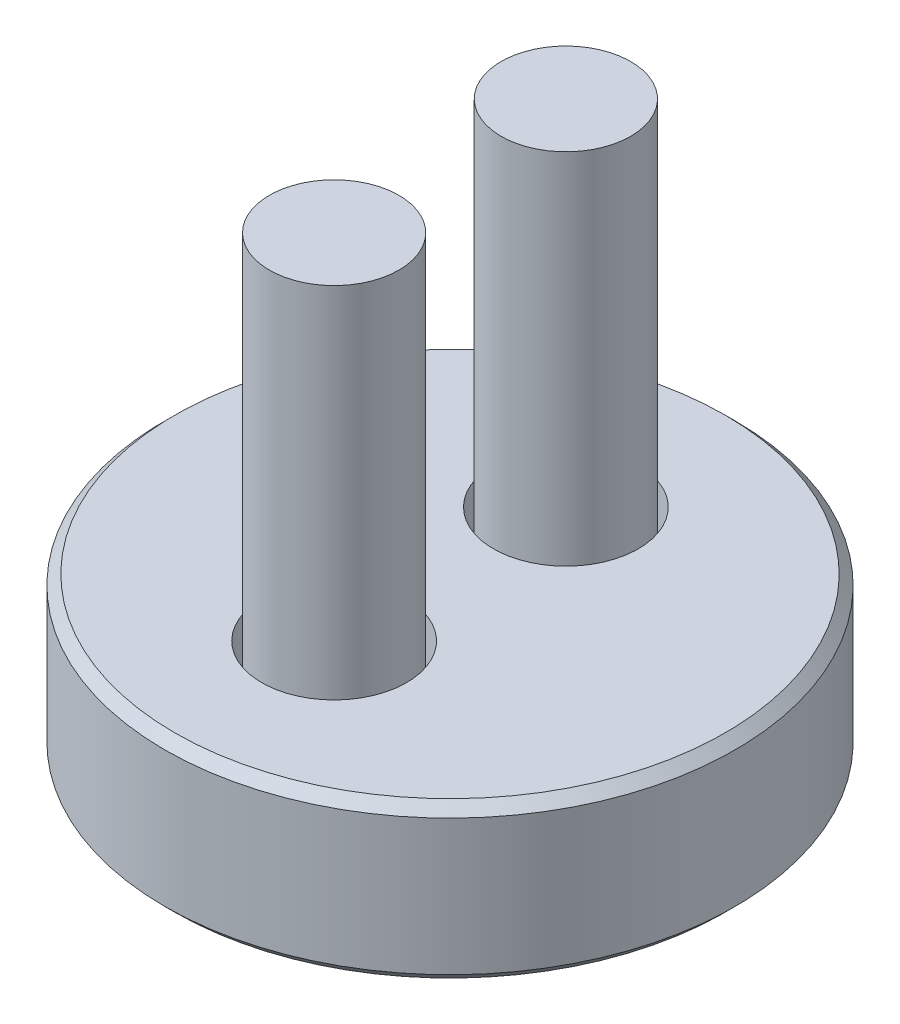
ISO-10303-21;
HEADER;
FILE_DESCRIPTION(('STEP AP214'),'2;1');
FILE_NAME('part.step','',(''),(''),'','','');
FILE_SCHEMA(('AUTOMOTIVE_DESIGN { 1 0 10303 214 1 1 1 1 }'));
ENDSEC;
DATA;
#1=APPLICATION_CONTEXT('core data for automotive mechanical design processes');
#2=APPLICATION_PROTOCOL_DEFINITION('international standard','automotive_design',2000,#1);
#3=PRODUCT_CONTEXT('',#1,'mechanical');
#4=PRODUCT('Part','Part','',(#3));
#5=PRODUCT_RELATED_PRODUCT_CATEGORY('part','',(#4));
#6=PRODUCT_DEFINITION_FORMATION('','',#4);
#7=PRODUCT_DEFINITION_CONTEXT('part definition',#1,'design');
#8=PRODUCT_DEFINITION('design','',#6,#7);
#9=PRODUCT_DEFINITION_SHAPE('','',#8);
#10=(LENGTH_UNIT() NAMED_UNIT(*) SI_UNIT(.MILLI.,.METRE.));
#11=(NAMED_UNIT(*) PLANE_ANGLE_UNIT() SI_UNIT($,.RADIAN.));
#12=(NAMED_UNIT(*) SI_UNIT($,.STERADIAN.) SOLID_ANGLE_UNIT());
#13=UNCERTAINTY_MEASURE_WITH_UNIT(LENGTH_MEASURE(1.E-05),#10,'distance_accuracy_value','');
#14=(GEOMETRIC_REPRESENTATION_CONTEXT(3) GLOBAL_UNCERTAINTY_ASSIGNED_CONTEXT((#13)) GLOBAL_UNIT_ASSIGNED_CONTEXT((#10,
#11,#12)) REPRESENTATION_CONTEXT('',''));
#15=CARTESIAN_POINT('',(0.,0.,0.));
#16=DIRECTION('',(0.,0.,1.));
#17=DIRECTION('',(1.,0.,0.));
#18=AXIS2_PLACEMENT_3D('',#15,#16,#17);
#19=CARTESIAN_POINT('',(0.,19.6322,4.4704));
#20=DIRECTION('',(0.,1.,0.));
#21=DIRECTION('',(1.,0.,0.));
#22=AXIS2_PLACEMENT_3D('',#19,#20,#21);
#23=PLANE('',#22);
#24=CARTESIAN_POINT('',(0.,19.6322,4.4704));
#25=DIRECTION('',(0.,-1.,0.));
#26=DIRECTION('',(1.,0.,0.));
#27=AXIS2_PLACEMENT_3D('',#24,#25,#26);
#28=CIRCLE('',#27,2.5);
#29=CARTESIAN_POINT('',(2.5,19.6322,4.4704));
#30=VERTEX_POINT('',#29);
#31=EDGE_CURVE('E12',#30,#30,#28,.T.);
#32=ORIENTED_EDGE('',*,*,#31,.F.);
#33=EDGE_LOOP('',(#32));
#34=FACE_BOUND('',#33,.T.);
#35=ADVANCED_FACE('F47',(#34),#23,.T.);
#36=CARTESIAN_POINT('',(0.,19.6322,4.4704));
#37=DIRECTION('',(0.,1.,0.));
#38=DIRECTION('',(1.,0.,0.));
#39=AXIS2_PLACEMENT_3D('',#36,#37,#38);
#40=CYLINDRICAL_SURFACE('',#39,2.5);
#41=CARTESIAN_POINT('',(0.,3.6322,4.4704));
#42=DIRECTION('',(0.,-1.,0.));
#43=DIRECTION('',(1.,0.,0.));
#44=AXIS2_PLACEMENT_3D('',#41,#42,#43);
#45=CIRCLE('',#44,2.5);
#46=CARTESIAN_POINT('',(2.5,3.6322,4.4704));
#47=VERTEX_POINT('',#46);
#48=EDGE_CURVE('E54',#47,#47,#45,.T.);
#49=ORIENTED_EDGE('',*,*,#48,.F.);
#50=EDGE_LOOP('',(#49));
#51=FACE_BOUND('',#50,.T.);
#52=ORIENTED_EDGE('',*,*,#31,.T.);
#53=EDGE_LOOP('',(#52));
#54=FACE_BOUND('',#53,.T.);
#55=ADVANCED_FACE('F146',(#51,#54),#40,.T.);
#56=CARTESIAN_POINT('',(0.,3.6322,1.9704));
#57=DIRECTION('',(0.,1.,0.));
#58=DIRECTION('',(1.,0.,0.));
#59=AXIS2_PLACEMENT_3D('',#56,#57,#58);
#60=PLANE('',#59);
#61=CARTESIAN_POINT('',(0.,3.6322,4.4704));
#62=DIRECTION('',(0.,-1.,0.));
#63=DIRECTION('',(1.,0.,0.));
#64=AXIS2_PLACEMENT_3D('',#61,#62,#63);
#65=CIRCLE('',#64,4.25);
#66=CARTESIAN_POINT('',(4.25,3.6322,4.4704));
#67=VERTEX_POINT('',#66);
#68=EDGE_CURVE('E139',#67,#67,#65,.T.);
#69=ORIENTED_EDGE('',*,*,#68,.F.);
#70=EDGE_LOOP('',(#69));
#71=FACE_BOUND('',#70,.T.);
#72=ORIENTED_EDGE('',*,*,#48,.T.);
#73=EDGE_LOOP('',(#72));
#74=FACE_BOUND('',#73,.T.);
#75=ADVANCED_FACE('F144',(#71,#74),#60,.T.);
#76=CARTESIAN_POINT('',(0.,19.6322,4.4704));
#77=DIRECTION('',(0.,1.,0.));
#78=DIRECTION('',(1.,0.,0.));
#79=AXIS2_PLACEMENT_3D('',#76,#77,#78);
#80=CYLINDRICAL_SURFACE('',#79,4.25);
#81=CARTESIAN_POINT('',(0.,0.132199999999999,4.4704));
#82=DIRECTION('',(0.,-1.,0.));
#83=DIRECTION('',(1.,0.,0.));
#84=AXIS2_PLACEMENT_3D('',#81,#82,#83);
#85=CIRCLE('',#84,4.25);
#86=CARTESIAN_POINT('',(4.25,0.132199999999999,4.4704));
#87=VERTEX_POINT('',#86);
#88=EDGE_CURVE('E136',#87,#87,#85,.T.);
#89=ORIENTED_EDGE('',*,*,#88,.F.);
#90=EDGE_LOOP('',(#89));
#91=FACE_BOUND('',#90,.T.);
#92=ORIENTED_EDGE('',*,*,#68,.T.);
#93=EDGE_LOOP('',(#92));
#94=FACE_BOUND('',#93,.T.);
#95=ADVANCED_FACE('F164',(#91,#94),#80,.T.);
#96=CARTESIAN_POINT('',(0.,0.132199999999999,0.220399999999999));
#97=DIRECTION('',(0.,-1.,0.));
#98=DIRECTION('',(-1.,0.,0.));
#99=AXIS2_PLACEMENT_3D('',#96,#97,#98);
#100=PLANE('',#99);
#101=DIRECTION('',(0.866025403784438,0.,-0.5));
#102=VECTOR('',#101,1.);
#103=CARTESIAN_POINT('',(0.,0.132199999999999,6.20245080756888));
#104=LINE('',#103,#102);
#105=CARTESIAN_POINT('',(0.,0.132199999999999,6.20245080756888));
#106=VERTEX_POINT('',#105);
#107=CARTESIAN_POINT('',(1.5,0.132199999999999,5.33642540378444));
#108=VERTEX_POINT('',#107);
#109=EDGE_CURVE('E262',#106,#108,#104,.T.);
#110=ORIENTED_EDGE('',*,*,#109,.T.);
#111=DIRECTION('',(0.,0.,-1.));
#112=VECTOR('',#111,1.);
#113=CARTESIAN_POINT('',(1.5,0.132199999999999,5.33642540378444));
#114=LINE('',#113,#112);
#115=CARTESIAN_POINT('',(1.5,0.132199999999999,3.60437459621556));
#116=VERTEX_POINT('',#115);
#117=EDGE_CURVE('E256',#108,#116,#114,.T.);
#118=ORIENTED_EDGE('',*,*,#117,.T.);
#119=DIRECTION('',(-0.866025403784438,0.,-0.5));
#120=VECTOR('',#119,1.);
#121=CARTESIAN_POINT('',(1.5,0.132199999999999,3.60437459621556));
#122=LINE('',#121,#120);
#123=CARTESIAN_POINT('',(0.,0.132199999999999,2.73834919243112));
#124=VERTEX_POINT('',#123);
#125=EDGE_CURVE('E261',#116,#124,#122,.T.);
#126=ORIENTED_EDGE('',*,*,#125,.T.);
#127=DIRECTION('',(-0.866025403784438,0.,0.5));
#128=VECTOR('',#127,1.);
#129=CARTESIAN_POINT('',(0.,0.132199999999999,2.73834919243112));
#130=LINE('',#129,#128);
#131=CARTESIAN_POINT('',(-1.5,0.132199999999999,3.60437459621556));
#132=VERTEX_POINT('',#131);
#133=EDGE_CURVE('E270',#124,#132,#130,.T.);
#134=ORIENTED_EDGE('',*,*,#133,.T.);
#135=DIRECTION('',(0.,0.,1.));
#136=VECTOR('',#135,1.);
#137=CARTESIAN_POINT('',(-1.5,0.132199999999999,3.60437459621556));
#138=LINE('',#137,#136);
#139=CARTESIAN_POINT('',(-1.5,0.132199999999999,5.33642540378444));
#140=VERTEX_POINT('',#139);
#141=EDGE_CURVE('E125',#132,#140,#138,.T.);
#142=ORIENTED_EDGE('',*,*,#141,.T.);
#143=DIRECTION('',(0.866025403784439,0.,0.5));
#144=VECTOR('',#143,1.);
#145=CARTESIAN_POINT('',(-1.5,0.132199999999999,5.33642540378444));
#146=LINE('',#145,#144);
#147=EDGE_CURVE('E265',#140,#106,#146,.T.);
#148=ORIENTED_EDGE('',*,*,#147,.T.);
#149=EDGE_LOOP('',(#110,#118,#126,#134,#142,#148));
#150=FACE_BOUND('',#149,.T.);
#151=ORIENTED_EDGE('',*,*,#88,.T.);
#152=EDGE_LOOP('',(#151));
#153=FACE_BOUND('',#152,.T.);
#154=ADVANCED_FACE('F172',(#150,#153),#100,.T.);
#155=CARTESIAN_POINT('',(0.,2.6322,6.20245080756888));
#156=DIRECTION('',(0.5,0.,0.866025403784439));
#157=DIRECTION('',(-0.866025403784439,0.,0.5));
#158=AXIS2_PLACEMENT_3D('',#155,#156,#157);
#159=PLANE('',#158);
#160=ORIENTED_EDGE('',*,*,#109,.F.);
#161=DIRECTION('',(0.,-1.,0.));
#162=VECTOR('',#161,1.);
#163=CARTESIAN_POINT('',(0.,2.6322,6.20245080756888));
#164=LINE('',#163,#162);
#165=CARTESIAN_POINT('',(0.,2.6322,6.20245080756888));
#166=VERTEX_POINT('',#165);
#167=EDGE_CURVE('E92',#166,#106,#164,.T.);
#168=ORIENTED_EDGE('',*,*,#167,.F.);
#169=DIRECTION('',(0.866025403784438,0.,-0.5));
#170=VECTOR('',#169,1.);
#171=CARTESIAN_POINT('',(0.,2.6322,6.20245080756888));
#172=LINE('',#171,#170);
#173=CARTESIAN_POINT('',(1.5,2.6322,5.33642540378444));
#174=VERTEX_POINT('',#173);
#175=EDGE_CURVE('E273',#166,#174,#172,.T.);
#176=ORIENTED_EDGE('',*,*,#175,.T.);
#177=DIRECTION('',(0.,-1.,0.));
#178=VECTOR('',#177,1.);
#179=CARTESIAN_POINT('',(1.5,2.6322,5.33642540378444));
#180=LINE('',#179,#178);
#181=EDGE_CURVE('E61',#174,#108,#180,.T.);
#182=ORIENTED_EDGE('',*,*,#181,.T.);
#183=EDGE_LOOP('',(#160,#168,#176,#182));
#184=FACE_BOUND('',#183,.T.);
#185=ADVANCED_FACE('F180',(#184),#159,.F.);
#186=CARTESIAN_POINT('',(-1.5,2.6322,5.33642540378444));
#187=DIRECTION('',(-0.5,0.,0.866025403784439));
#188=DIRECTION('',(-0.866025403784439,0.,-0.5));
#189=AXIS2_PLACEMENT_3D('',#186,#187,#188);
#190=PLANE('',#189);
#191=ORIENTED_EDGE('',*,*,#147,.F.);
#192=DIRECTION('',(0.,-1.,0.));
#193=VECTOR('',#192,1.);
#194=CARTESIAN_POINT('',(-1.5,2.6322,5.33642540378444));
#195=LINE('',#194,#193);
#196=CARTESIAN_POINT('',(-1.5,2.6322,5.33642540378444));
#197=VERTEX_POINT('',#196);
#198=EDGE_CURVE('E127',#197,#140,#195,.T.);
#199=ORIENTED_EDGE('',*,*,#198,.F.);
#200=DIRECTION('',(0.866025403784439,0.,0.5));
#201=VECTOR('',#200,1.);
#202=CARTESIAN_POINT('',(-1.5,2.6322,5.33642540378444));
#203=LINE('',#202,#201);
#204=EDGE_CURVE('E70',#197,#166,#203,.T.);
#205=ORIENTED_EDGE('',*,*,#204,.T.);
#206=ORIENTED_EDGE('',*,*,#167,.T.);
#207=EDGE_LOOP('',(#191,#199,#205,#206));
#208=FACE_BOUND('',#207,.T.);
#209=ADVANCED_FACE('F188',(#208),#190,.F.);
#210=CARTESIAN_POINT('',(-1.5,2.6322,3.60437459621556));
#211=DIRECTION('',(-1.,0.,0.));
#212=DIRECTION('',(0.,0.,-1.));
#213=AXIS2_PLACEMENT_3D('',#210,#211,#212);
#214=PLANE('',#213);
#215=ORIENTED_EDGE('',*,*,#141,.F.);
#216=DIRECTION('',(0.,-1.,0.));
#217=VECTOR('',#216,1.);
#218=CARTESIAN_POINT('',(-1.5,2.6322,3.60437459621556));
#219=LINE('',#218,#217);
#220=CARTESIAN_POINT('',(-1.5,2.6322,3.60437459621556));
#221=VERTEX_POINT('',#220);
#222=EDGE_CURVE('E114',#221,#132,#219,.T.);
#223=ORIENTED_EDGE('',*,*,#222,.F.);
#224=DIRECTION('',(0.,0.,1.));
#225=VECTOR('',#224,1.);
#226=CARTESIAN_POINT('',(-1.5,2.6322,3.60437459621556));
#227=LINE('',#226,#225);
#228=EDGE_CURVE('E117',#221,#197,#227,.T.);
#229=ORIENTED_EDGE('',*,*,#228,.T.);
#230=ORIENTED_EDGE('',*,*,#198,.T.);
#231=EDGE_LOOP('',(#215,#223,#229,#230));
#232=FACE_BOUND('',#231,.T.);
#233=ADVANCED_FACE('F123',(#232),#214,.F.);
#234=CARTESIAN_POINT('',(0.,2.6322,2.73834919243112));
#235=DIRECTION('',(-0.5,0.,-0.866025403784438));
#236=DIRECTION('',(0.866025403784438,0.,-0.5));
#237=AXIS2_PLACEMENT_3D('',#234,#235,#236);
#238=PLANE('',#237);
#239=ORIENTED_EDGE('',*,*,#133,.F.);
#240=DIRECTION('',(0.,-1.,0.));
#241=VECTOR('',#240,1.);
#242=CARTESIAN_POINT('',(0.,2.6322,2.73834919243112));
#243=LINE('',#242,#241);
#244=CARTESIAN_POINT('',(0.,2.6322,2.73834919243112));
#245=VERTEX_POINT('',#244);
#246=EDGE_CURVE('E116',#245,#124,#243,.T.);
#247=ORIENTED_EDGE('',*,*,#246,.F.);
#248=DIRECTION('',(-0.866025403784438,0.,0.5));
#249=VECTOR('',#248,1.);
#250=CARTESIAN_POINT('',(0.,2.6322,2.73834919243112));
#251=LINE('',#250,#249);
#252=EDGE_CURVE('E109',#245,#221,#251,.T.);
#253=ORIENTED_EDGE('',*,*,#252,.T.);
#254=ORIENTED_EDGE('',*,*,#222,.T.);
#255=EDGE_LOOP('',(#239,#247,#253,#254));
#256=FACE_BOUND('',#255,.T.);
#257=ADVANCED_FACE('F112',(#256),#238,.F.);
#258=CARTESIAN_POINT('',(1.5,2.6322,3.60437459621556));
#259=DIRECTION('',(0.5,0.,-0.866025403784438));
#260=DIRECTION('',(0.866025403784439,0.,0.5));
#261=AXIS2_PLACEMENT_3D('',#258,#259,#260);
#262=PLANE('',#261);
#263=ORIENTED_EDGE('',*,*,#125,.F.);
#264=DIRECTION('',(0.,-1.,0.));
#265=VECTOR('',#264,1.);
#266=CARTESIAN_POINT('',(1.5,2.6322,3.60437459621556));
#267=LINE('',#266,#265);
#268=CARTESIAN_POINT('',(1.5,2.6322,3.60437459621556));
#269=VERTEX_POINT('',#268);
#270=EDGE_CURVE('E130',#269,#116,#267,.T.);
#271=ORIENTED_EDGE('',*,*,#270,.F.);
#272=DIRECTION('',(-0.866025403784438,0.,-0.5));
#273=VECTOR('',#272,1.);
#274=CARTESIAN_POINT('',(1.5,2.6322,3.60437459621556));
#275=LINE('',#274,#273);
#276=EDGE_CURVE('E118',#269,#245,#275,.T.);
#277=ORIENTED_EDGE('',*,*,#276,.T.);
#278=ORIENTED_EDGE('',*,*,#246,.T.);
#279=EDGE_LOOP('',(#263,#271,#277,#278));
#280=FACE_BOUND('',#279,.T.);
#281=ADVANCED_FACE('F207',(#280),#262,.F.);
#282=CARTESIAN_POINT('',(1.5,2.6322,5.33642540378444));
#283=DIRECTION('',(1.,0.,0.));
#284=DIRECTION('',(0.,-1.,0.));
#285=AXIS2_PLACEMENT_3D('',#282,#283,#284);
#286=PLANE('',#285);
#287=ORIENTED_EDGE('',*,*,#117,.F.);
#288=ORIENTED_EDGE('',*,*,#181,.F.);
#289=DIRECTION('',(0.,0.,-1.));
#290=VECTOR('',#289,1.);
#291=CARTESIAN_POINT('',(1.5,2.6322,5.33642540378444));
#292=LINE('',#291,#290);
#293=EDGE_CURVE('E100',#174,#269,#292,.T.);
#294=ORIENTED_EDGE('',*,*,#293,.T.);
#295=ORIENTED_EDGE('',*,*,#270,.T.);
#296=EDGE_LOOP('',(#287,#288,#294,#295));
#297=FACE_BOUND('',#296,.T.);
#298=ADVANCED_FACE('F214',(#297),#286,.F.);
#299=CARTESIAN_POINT('',(3.,2.6322,4.4704));
#300=DIRECTION('',(0.,-1.,0.));
#301=DIRECTION('',(-1.,0.,0.));
#302=AXIS2_PLACEMENT_3D('',#299,#300,#301);
#303=PLANE('',#302);
#304=ORIENTED_EDGE('',*,*,#175,.F.);
#305=ORIENTED_EDGE('',*,*,#204,.F.);
#306=ORIENTED_EDGE('',*,*,#228,.F.);
#307=ORIENTED_EDGE('',*,*,#252,.F.);
#308=ORIENTED_EDGE('',*,*,#276,.F.);
#309=ORIENTED_EDGE('',*,*,#293,.F.);
#310=EDGE_LOOP('',(#304,#305,#306,#307,#308,#309));
#311=FACE_BOUND('',#310,.T.);
#312=ADVANCED_FACE('F120',(#311),#303,.T.);
#313=CLOSED_SHELL('',(#35,#55,#75,#95,#154,#185,#209,#233,#257,#281,#298,#312));
#314=MANIFOLD_SOLID_BREP('B2',#313);
#315=CARTESIAN_POINT('',(0.,19.6322,-4.4704));
#316=DIRECTION('',(0.,1.,0.));
#317=DIRECTION('',(1.,0.,0.));
#318=AXIS2_PLACEMENT_3D('',#315,#316,#317);
#319=PLANE('',#318);
#320=CARTESIAN_POINT('',(0.,19.6322,-4.4704));
#321=DIRECTION('',(0.,1.,0.));
#322=DIRECTION('',(1.,0.,0.));
#323=AXIS2_PLACEMENT_3D('',#320,#321,#322);
#324=CIRCLE('',#323,2.5);
#325=CARTESIAN_POINT('',(2.5,19.6322,-4.4704));
#326=VERTEX_POINT('',#325);
#327=EDGE_CURVE('E45',#326,#326,#324,.T.);
#328=ORIENTED_EDGE('',*,*,#327,.T.);
#329=EDGE_LOOP('',(#328));
#330=FACE_BOUND('',#329,.T.);
#331=ADVANCED_FACE('F292',(#330),#319,.T.);
#332=CARTESIAN_POINT('',(0.,19.6322,-4.4704));
#333=DIRECTION('',(0.,1.,0.));
#334=DIRECTION('',(1.,0.,0.));
#335=AXIS2_PLACEMENT_3D('',#332,#333,#334);
#336=CYLINDRICAL_SURFACE('',#335,2.5);
#337=CARTESIAN_POINT('',(0.,3.6322,-4.4704));
#338=DIRECTION('',(0.,1.,0.));
#339=DIRECTION('',(1.,0.,0.));
#340=AXIS2_PLACEMENT_3D('',#337,#338,#339);
#341=CIRCLE('',#340,2.5);
#342=CARTESIAN_POINT('',(2.5,3.6322,-4.4704));
#343=VERTEX_POINT('',#342);
#344=EDGE_CURVE('E299',#343,#343,#341,.T.);
#345=ORIENTED_EDGE('',*,*,#344,.T.);
#346=EDGE_LOOP('',(#345));
#347=FACE_BOUND('',#346,.T.);
#348=ORIENTED_EDGE('',*,*,#327,.F.);
#349=EDGE_LOOP('',(#348));
#350=FACE_BOUND('',#349,.T.);
#351=ADVANCED_FACE('F406',(#347,#350),#336,.T.);
#352=CARTESIAN_POINT('',(0.,3.6322,-1.9704));
#353=DIRECTION('',(0.,1.,0.));
#354=DIRECTION('',(1.,0.,0.));
#355=AXIS2_PLACEMENT_3D('',#352,#353,#354);
#356=PLANE('',#355);
#357=CARTESIAN_POINT('',(0.,3.6322,-4.4704));
#358=DIRECTION('',(0.,1.,0.));
#359=DIRECTION('',(1.,0.,0.));
#360=AXIS2_PLACEMENT_3D('',#357,#358,#359);
#361=CIRCLE('',#360,4.25);
#362=CARTESIAN_POINT('',(4.25,3.6322,-4.4704));
#363=VERTEX_POINT('',#362);
#364=EDGE_CURVE('E401',#363,#363,#361,.T.);
#365=ORIENTED_EDGE('',*,*,#364,.T.);
#366=EDGE_LOOP('',(#365));
#367=FACE_BOUND('',#366,.T.);
#368=ORIENTED_EDGE('',*,*,#344,.F.);
#369=EDGE_LOOP('',(#368));
#370=FACE_BOUND('',#369,.T.);
#371=ADVANCED_FACE('F409',(#367,#370),#356,.T.);
#372=CARTESIAN_POINT('',(0.,19.6322,-4.4704));
#373=DIRECTION('',(0.,1.,0.));
#374=DIRECTION('',(1.,0.,0.));
#375=AXIS2_PLACEMENT_3D('',#372,#373,#374);
#376=CYLINDRICAL_SURFACE('',#375,4.25);
#377=CARTESIAN_POINT('',(0.,0.132199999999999,-4.4704));
#378=DIRECTION('',(0.,1.,0.));
#379=DIRECTION('',(1.,0.,0.));
#380=AXIS2_PLACEMENT_3D('',#377,#378,#379);
#381=CIRCLE('',#380,4.25);
#382=CARTESIAN_POINT('',(4.25,0.132199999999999,-4.4704));
#383=VERTEX_POINT('',#382);
#384=EDGE_CURVE('E393',#383,#383,#381,.T.);
#385=ORIENTED_EDGE('',*,*,#384,.T.);
#386=EDGE_LOOP('',(#385));
#387=FACE_BOUND('',#386,.T.);
#388=ORIENTED_EDGE('',*,*,#364,.F.);
#389=EDGE_LOOP('',(#388));
#390=FACE_BOUND('',#389,.T.);
#391=ADVANCED_FACE('F411',(#387,#390),#376,.T.);
#392=CARTESIAN_POINT('',(0.,0.132199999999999,-0.220399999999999));
#393=DIRECTION('',(0.,-1.,0.));
#394=DIRECTION('',(-1.,0.,0.));
#395=AXIS2_PLACEMENT_3D('',#392,#393,#394);
#396=PLANE('',#395);
#397=DIRECTION('',(0.866025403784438,0.,0.5));
#398=VECTOR('',#397,1.);
#399=CARTESIAN_POINT('',(0.,0.132199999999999,-6.20245080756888));
#400=LINE('',#399,#398);
#401=CARTESIAN_POINT('',(0.,0.132199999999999,-6.20245080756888));
#402=VERTEX_POINT('',#401);
#403=CARTESIAN_POINT('',(1.5,0.132199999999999,-5.33642540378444));
#404=VERTEX_POINT('',#403);
#405=EDGE_CURVE('E306',#402,#404,#400,.T.);
#406=ORIENTED_EDGE('',*,*,#405,.F.);
#407=DIRECTION('',(0.866025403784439,0.,-0.5));
#408=VECTOR('',#407,1.);
#409=CARTESIAN_POINT('',(-1.5,0.132199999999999,-5.33642540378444));
#410=LINE('',#409,#408);
#411=CARTESIAN_POINT('',(-1.5,0.132199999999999,-5.33642540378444));
#412=VERTEX_POINT('',#411);
#413=EDGE_CURVE('E389',#412,#402,#410,.T.);
#414=ORIENTED_EDGE('',*,*,#413,.F.);
#415=DIRECTION('',(0.,0.,-1.));
#416=VECTOR('',#415,1.);
#417=CARTESIAN_POINT('',(-1.5,0.132199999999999,-3.60437459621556));
#418=LINE('',#417,#416);
#419=CARTESIAN_POINT('',(-1.5,0.132199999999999,-3.60437459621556));
#420=VERTEX_POINT('',#419);
#421=EDGE_CURVE('E387',#420,#412,#418,.T.);
#422=ORIENTED_EDGE('',*,*,#421,.F.);
#423=DIRECTION('',(-0.866025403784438,0.,-0.5));
#424=VECTOR('',#423,1.);
#425=CARTESIAN_POINT('',(0.,0.132199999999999,-2.73834919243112));
#426=LINE('',#425,#424);
#427=CARTESIAN_POINT('',(0.,0.132199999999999,-2.73834919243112));
#428=VERTEX_POINT('',#427);
#429=EDGE_CURVE('E354',#428,#420,#426,.T.);
#430=ORIENTED_EDGE('',*,*,#429,.F.);
#431=DIRECTION('',(-0.866025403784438,0.,0.5));
#432=VECTOR('',#431,1.);
#433=CARTESIAN_POINT('',(1.5,0.132199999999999,-3.60437459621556));
#434=LINE('',#433,#432);
#435=CARTESIAN_POINT('',(1.5,0.132199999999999,-3.60437459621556));
#436=VERTEX_POINT('',#435);
#437=EDGE_CURVE('E383',#436,#428,#434,.T.);
#438=ORIENTED_EDGE('',*,*,#437,.F.);
#439=DIRECTION('',(0.,0.,1.));
#440=VECTOR('',#439,1.);
#441=CARTESIAN_POINT('',(1.5,0.132199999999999,-5.33642540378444));
#442=LINE('',#441,#440);
#443=EDGE_CURVE('E380',#404,#436,#442,.T.);
#444=ORIENTED_EDGE('',*,*,#443,.F.);
#445=EDGE_LOOP('',(#406,#414,#422,#430,#438,#444));
#446=FACE_BOUND('',#445,.T.);
#447=ORIENTED_EDGE('',*,*,#384,.F.);
#448=EDGE_LOOP('',(#447));
#449=FACE_BOUND('',#448,.T.);
#450=ADVANCED_FACE('F418',(#446,#449),#396,.T.);
#451=CARTESIAN_POINT('',(0.,2.6322,-6.20245080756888));
#452=DIRECTION('',(0.5,0.,-0.866025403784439));
#453=DIRECTION('',(-0.866025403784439,0.,-0.5));
#454=AXIS2_PLACEMENT_3D('',#451,#452,#453);
#455=PLANE('',#454);
#456=ORIENTED_EDGE('',*,*,#405,.T.);
#457=DIRECTION('',(0.,-1.,0.));
#458=VECTOR('',#457,1.);
#459=CARTESIAN_POINT('',(1.5,2.6322,-5.33642540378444));
#460=LINE('',#459,#458);
#461=CARTESIAN_POINT('',(1.5,2.6322,-5.33642540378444));
#462=VERTEX_POINT('',#461);
#463=EDGE_CURVE('E336',#462,#404,#460,.T.);
#464=ORIENTED_EDGE('',*,*,#463,.F.);
#465=DIRECTION('',(0.866025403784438,0.,0.5));
#466=VECTOR('',#465,1.);
#467=CARTESIAN_POINT('',(0.,2.6322,-6.20245080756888));
#468=LINE('',#467,#466);
#469=CARTESIAN_POINT('',(0.,2.6322,-6.20245080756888));
#470=VERTEX_POINT('',#469);
#471=EDGE_CURVE('E391',#470,#462,#468,.T.);
#472=ORIENTED_EDGE('',*,*,#471,.F.);
#473=DIRECTION('',(0.,-1.,0.));
#474=VECTOR('',#473,1.);
#475=CARTESIAN_POINT('',(0.,2.6322,-6.20245080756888));
#476=LINE('',#475,#474);
#477=EDGE_CURVE('E314',#470,#402,#476,.T.);
#478=ORIENTED_EDGE('',*,*,#477,.T.);
#479=EDGE_LOOP('',(#456,#464,#472,#478));
#480=FACE_BOUND('',#479,.T.);
#481=ADVANCED_FACE('F449',(#480),#455,.F.);
#482=CARTESIAN_POINT('',(-1.5,2.6322,-5.33642540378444));
#483=DIRECTION('',(-0.5,0.,-0.866025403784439));
#484=DIRECTION('',(-0.866025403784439,0.,0.5));
#485=AXIS2_PLACEMENT_3D('',#482,#483,#484);
#486=PLANE('',#485);
#487=ORIENTED_EDGE('',*,*,#413,.T.);
#488=ORIENTED_EDGE('',*,*,#477,.F.);
#489=DIRECTION('',(0.866025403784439,0.,-0.5));
#490=VECTOR('',#489,1.);
#491=CARTESIAN_POINT('',(-1.5,2.6322,-5.33642540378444));
#492=LINE('',#491,#490);
#493=CARTESIAN_POINT('',(-1.5,2.6322,-5.33642540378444));
#494=VERTEX_POINT('',#493);
#495=EDGE_CURVE('E366',#494,#470,#492,.T.);
#496=ORIENTED_EDGE('',*,*,#495,.F.);
#497=DIRECTION('',(0.,-1.,0.));
#498=VECTOR('',#497,1.);
#499=CARTESIAN_POINT('',(-1.5,2.6322,-5.33642540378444));
#500=LINE('',#499,#498);
#501=EDGE_CURVE('E358',#494,#412,#500,.T.);
#502=ORIENTED_EDGE('',*,*,#501,.T.);
#503=EDGE_LOOP('',(#487,#488,#496,#502));
#504=FACE_BOUND('',#503,.T.);
#505=ADVANCED_FACE('F459',(#504),#486,.F.);
#506=CARTESIAN_POINT('',(-1.5,2.6322,-3.60437459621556));
#507=DIRECTION('',(-1.,0.,0.));
#508=DIRECTION('',(0.,0.,1.));
#509=AXIS2_PLACEMENT_3D('',#506,#507,#508);
#510=PLANE('',#509);
#511=ORIENTED_EDGE('',*,*,#421,.T.);
#512=ORIENTED_EDGE('',*,*,#501,.F.);
#513=DIRECTION('',(0.,0.,-1.));
#514=VECTOR('',#513,1.);
#515=CARTESIAN_POINT('',(-1.5,2.6322,-3.60437459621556));
#516=LINE('',#515,#514);
#517=CARTESIAN_POINT('',(-1.5,2.6322,-3.60437459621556));
#518=VERTEX_POINT('',#517);
#519=EDGE_CURVE('E362',#518,#494,#516,.T.);
#520=ORIENTED_EDGE('',*,*,#519,.F.);
#521=DIRECTION('',(0.,-1.,0.));
#522=VECTOR('',#521,1.);
#523=CARTESIAN_POINT('',(-1.5,2.6322,-3.60437459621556));
#524=LINE('',#523,#522);
#525=EDGE_CURVE('E347',#518,#420,#524,.T.);
#526=ORIENTED_EDGE('',*,*,#525,.T.);
#527=EDGE_LOOP('',(#511,#512,#520,#526));
#528=FACE_BOUND('',#527,.T.);
#529=ADVANCED_FACE('F363',(#528),#510,.F.);
#530=CARTESIAN_POINT('',(0.,2.6322,-2.73834919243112));
#531=DIRECTION('',(-0.5,0.,0.866025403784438));
#532=DIRECTION('',(0.866025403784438,0.,0.5));
#533=AXIS2_PLACEMENT_3D('',#530,#531,#532);
#534=PLANE('',#533);
#535=ORIENTED_EDGE('',*,*,#429,.T.);
#536=ORIENTED_EDGE('',*,*,#525,.F.);
#537=DIRECTION('',(-0.866025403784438,0.,-0.5));
#538=VECTOR('',#537,1.);
#539=CARTESIAN_POINT('',(0.,2.6322,-2.73834919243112));
#540=LINE('',#539,#538);
#541=CARTESIAN_POINT('',(0.,2.6322,-2.73834919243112));
#542=VERTEX_POINT('',#541);
#543=EDGE_CURVE('E351',#542,#518,#540,.T.);
#544=ORIENTED_EDGE('',*,*,#543,.F.);
#545=DIRECTION('',(0.,-1.,0.));
#546=VECTOR('',#545,1.);
#547=CARTESIAN_POINT('',(0.,2.6322,-2.73834919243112));
#548=LINE('',#547,#546);
#549=EDGE_CURVE('E359',#542,#428,#548,.T.);
#550=ORIENTED_EDGE('',*,*,#549,.T.);
#551=EDGE_LOOP('',(#535,#536,#544,#550));
#552=FACE_BOUND('',#551,.T.);
#553=ADVANCED_FACE('F349',(#552),#534,.F.);
#554=CARTESIAN_POINT('',(1.5,2.6322,-3.60437459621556));
#555=DIRECTION('',(0.5,0.,0.866025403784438));
#556=DIRECTION('',(0.866025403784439,0.,-0.5));
#557=AXIS2_PLACEMENT_3D('',#554,#555,#556);
#558=PLANE('',#557);
#559=ORIENTED_EDGE('',*,*,#437,.T.);
#560=ORIENTED_EDGE('',*,*,#549,.F.);
#561=DIRECTION('',(-0.866025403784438,0.,0.5));
#562=VECTOR('',#561,1.);
#563=CARTESIAN_POINT('',(1.5,2.6322,-3.60437459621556));
#564=LINE('',#563,#562);
#565=CARTESIAN_POINT('',(1.5,2.6322,-3.60437459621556));
#566=VERTEX_POINT('',#565);
#567=EDGE_CURVE('E372',#566,#542,#564,.T.);
#568=ORIENTED_EDGE('',*,*,#567,.F.);
#569=DIRECTION('',(0.,-1.,0.));
#570=VECTOR('',#569,1.);
#571=CARTESIAN_POINT('',(1.5,2.6322,-3.60437459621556));
#572=LINE('',#571,#570);
#573=EDGE_CURVE('E396',#566,#436,#572,.T.);
#574=ORIENTED_EDGE('',*,*,#573,.T.);
#575=EDGE_LOOP('',(#559,#560,#568,#574));
#576=FACE_BOUND('',#575,.T.);
#577=ADVANCED_FACE('F484',(#576),#558,.F.);
#578=CARTESIAN_POINT('',(1.5,2.6322,-5.33642540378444));
#579=DIRECTION('',(1.,0.,0.));
#580=DIRECTION('',(0.,-1.,0.));
#581=AXIS2_PLACEMENT_3D('',#578,#579,#580);
#582=PLANE('',#581);
#583=ORIENTED_EDGE('',*,*,#443,.T.);
#584=ORIENTED_EDGE('',*,*,#573,.F.);
#585=DIRECTION('',(0.,0.,1.));
#586=VECTOR('',#585,1.);
#587=CARTESIAN_POINT('',(1.5,2.6322,-5.33642540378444));
#588=LINE('',#587,#586);
#589=EDGE_CURVE('E374',#462,#566,#588,.T.);
#590=ORIENTED_EDGE('',*,*,#589,.F.);
#591=ORIENTED_EDGE('',*,*,#463,.T.);
#592=EDGE_LOOP('',(#583,#584,#590,#591));
#593=FACE_BOUND('',#592,.T.);
#594=ADVANCED_FACE('F493',(#593),#582,.F.);
#595=CARTESIAN_POINT('',(3.,2.6322,-4.4704));
#596=DIRECTION('',(0.,-1.,0.));
#597=DIRECTION('',(-1.,0.,0.));
#598=AXIS2_PLACEMENT_3D('',#595,#596,#597);
#599=PLANE('',#598);
#600=ORIENTED_EDGE('',*,*,#471,.T.);
#601=ORIENTED_EDGE('',*,*,#589,.T.);
#602=ORIENTED_EDGE('',*,*,#567,.T.);
#603=ORIENTED_EDGE('',*,*,#543,.T.);
#604=ORIENTED_EDGE('',*,*,#519,.T.);
#605=ORIENTED_EDGE('',*,*,#495,.T.);
#606=EDGE_LOOP('',(#600,#601,#602,#603,#604,#605));
#607=FACE_BOUND('',#606,.T.);
#608=ADVANCED_FACE('F369',(#607),#599,.T.);
#609=CLOSED_SHELL('',(#331,#351,#371,#391,#450,#481,#505,#529,#553,#577,#594,#608));
#610=MANIFOLD_SOLID_BREP('B6',#609);
#611=CARTESIAN_POINT('',(0.,5.9944,0.));
#612=DIRECTION('',(0.,-1.,0.));
#613=DIRECTION('',(0.,0.,-1.));
#614=AXIS2_PLACEMENT_3D('',#611,#612,#613);
#615=CYLINDRICAL_SURFACE('',#614,10.9982);
#616=CARTESIAN_POINT('',(0.,0.381000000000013,0.));
#617=DIRECTION('',(0.,1.,0.));
#618=DIRECTION('',(0.,0.,1.));
#619=AXIS2_PLACEMENT_3D('',#616,#617,#618);
#620=CIRCLE('',#619,10.9982);
#621=CARTESIAN_POINT('',(0.,0.381000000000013,-10.9982));
#622=VERTEX_POINT('',#621);
#623=EDGE_CURVE('E619',#622,#622,#620,.T.);
#624=CARTESIAN_POINT('',(0.,5.61340000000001,0.));
#625=DIRECTION('',(0.,1.,0.));
#626=DIRECTION('',(0.,0.,1.));
#627=AXIS2_PLACEMENT_3D('',#624,#625,#626);
#628=CIRCLE('',#627,10.9982);
#629=CARTESIAN_POINT('',(0.,5.61340000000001,-10.9982));
#630=VERTEX_POINT('',#629);
#631=EDGE_CURVE('E616',#630,#630,#628,.F.);
#632=CARTESIAN_POINT('',(0.,0.381000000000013,-10.9982));
#633=CARTESIAN_POINT('',(0.,0.43550416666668,-10.9982));
#634=CARTESIAN_POINT('',(0.,0.490008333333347,-10.9982));
#635=CARTESIAN_POINT('',(0.,0.59901666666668,-10.9982));
#636=CARTESIAN_POINT('',(0.,0.653520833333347,-10.9982));
#637=CARTESIAN_POINT('',(0.,0.76252916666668,-10.9982));
#638=CARTESIAN_POINT('',(0.,0.817033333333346,-10.9982));
#639=CARTESIAN_POINT('',(0.,0.92604166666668,-10.9982));
#640=CARTESIAN_POINT('',(0.,0.980545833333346,-10.9982));
#641=CARTESIAN_POINT('',(0.,1.08955416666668,-10.9982));
#642=CARTESIAN_POINT('',(0.,1.14405833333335,-10.9982));
#643=CARTESIAN_POINT('',(0.,1.25306666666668,-10.9982));
#644=CARTESIAN_POINT('',(0.,1.30757083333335,-10.9982));
#645=CARTESIAN_POINT('',(0.,1.41657916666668,-10.9982));
#646=CARTESIAN_POINT('',(0.,1.47108333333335,-10.9982));
#647=CARTESIAN_POINT('',(0.,1.58009166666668,-10.9982));
#648=CARTESIAN_POINT('',(0.,1.63459583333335,-10.9982));
#649=CARTESIAN_POINT('',(0.,1.74360416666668,-10.9982));
#650=CARTESIAN_POINT('',(0.,1.79810833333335,-10.9982));
#651=CARTESIAN_POINT('',(0.,1.90711666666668,-10.9982));
#652=CARTESIAN_POINT('',(0.,1.96162083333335,-10.9982));
#653=CARTESIAN_POINT('',(0.,2.07062916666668,-10.9982));
#654=CARTESIAN_POINT('',(0.,2.12513333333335,-10.9982));
#655=CARTESIAN_POINT('',(0.,2.23414166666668,-10.9982));
#656=CARTESIAN_POINT('',(0.,2.28864583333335,-10.9982));
#657=CARTESIAN_POINT('',(0.,2.39765416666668,-10.9982));
#658=CARTESIAN_POINT('',(0.,2.45215833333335,-10.9982));
#659=CARTESIAN_POINT('',(0.,2.56116666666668,-10.9982));
#660=CARTESIAN_POINT('',(0.,2.61567083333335,-10.9982));
#661=CARTESIAN_POINT('',(0.,2.72467916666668,-10.9982));
#662=CARTESIAN_POINT('',(0.,2.77918333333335,-10.9982));
#663=CARTESIAN_POINT('',(0.,2.88819166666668,-10.9982));
#664=CARTESIAN_POINT('',(0.,2.94269583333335,-10.9982));
#665=CARTESIAN_POINT('',(0.,3.05170416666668,-10.9982));
#666=CARTESIAN_POINT('',(0.,3.10620833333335,-10.9982));
#667=CARTESIAN_POINT('',(0.,3.21521666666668,-10.9982));
#668=CARTESIAN_POINT('',(0.,3.26972083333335,-10.9982));
#669=CARTESIAN_POINT('',(0.,3.37872916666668,-10.9982));
#670=CARTESIAN_POINT('',(0.,3.43323333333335,-10.9982));
#671=CARTESIAN_POINT('',(0.,3.54224166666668,-10.9982));
#672=CARTESIAN_POINT('',(0.,3.59674583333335,-10.9982));
#673=CARTESIAN_POINT('',(0.,3.70575416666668,-10.9982));
#674=CARTESIAN_POINT('',(0.,3.76025833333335,-10.9982));
#675=CARTESIAN_POINT('',(0.,3.86926666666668,-10.9982));
#676=CARTESIAN_POINT('',(0.,3.92377083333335,-10.9982));
#677=CARTESIAN_POINT('',(0.,4.03277916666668,-10.9982));
#678=CARTESIAN_POINT('',(0.,4.08728333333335,-10.9982));
#679=CARTESIAN_POINT('',(0.,4.19629166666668,-10.9982));
#680=CARTESIAN_POINT('',(0.,4.25079583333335,-10.9982));
#681=CARTESIAN_POINT('',(0.,4.35980416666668,-10.9982));
#682=CARTESIAN_POINT('',(0.,4.41430833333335,-10.9982));
#683=CARTESIAN_POINT('',(0.,4.52331666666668,-10.9982));
#684=CARTESIAN_POINT('',(0.,4.57782083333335,-10.9982));
#685=CARTESIAN_POINT('',(0.,4.68682916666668,-10.9982));
#686=CARTESIAN_POINT('',(0.,4.74133333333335,-10.9982));
#687=CARTESIAN_POINT('',(0.,4.85034166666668,-10.9982));
#688=CARTESIAN_POINT('',(0.,4.90484583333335,-10.9982));
#689=CARTESIAN_POINT('',(0.,5.01385416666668,-10.9982));
#690=CARTESIAN_POINT('',(0.,5.06835833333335,-10.9982));
#691=CARTESIAN_POINT('',(0.,5.17736666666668,-10.9982));
#692=CARTESIAN_POINT('',(0.,5.23187083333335,-10.9982));
#693=CARTESIAN_POINT('',(0.,5.34087916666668,-10.9982));
#694=CARTESIAN_POINT('',(0.,5.39538333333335,-10.9982));
#695=CARTESIAN_POINT('',(0.,5.50439166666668,-10.9982));
#696=CARTESIAN_POINT('',(0.,5.55889583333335,-10.9982));
#697=CARTESIAN_POINT('',(0.,5.61340000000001,-10.9982));
#698=B_SPLINE_CURVE_WITH_KNOTS('',3,(#632,#633,#634,#635,#636,#637,#638,#639,#640,#641,#642,
#643,#644,#645,#646,#647,#648,#649,#650,#651,#652,#653,#654,#655,#656,#657,#658,#659,#660,#661,
#662,#663,#664,#665,#666,#667,#668,#669,#670,#671,#672,#673,#674,#675,#676,#677,#678,#679,#680,
#681,#682,#683,#684,#685,#686,#687,#688,#689,#690,#691,#692,#693,#694,#695,#696,#697),
.UNSPECIFIED.,.F.,.F.,(4,2,2,2,2,2,2,2,2,2,2,2,2,2,2,2,2,2,2,2,2,2,2,2,2,2,2,2,2,2,2,2,4),(0.,
0.1635125,0.327025,0.4905375,0.65405,0.817562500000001,0.981075,1.1445875,1.3081,1.4716125,
1.635125,1.7986375,1.96215,2.1256625,2.289175,2.4526875,2.6162,2.7797125,2.943225,3.1067375,
3.27025,3.4337625,3.597275,3.7607875,3.9243,4.0878125,4.251325,4.4148375,4.57835,4.7418625,
4.905375,5.0688875,5.2324),.UNSPECIFIED.);
#699=EDGE_CURVE('BSEAM527',#622,#630,#698,.T.);
#700=ORIENTED_EDGE('',*,*,#623,.T.);
#701=ORIENTED_EDGE('',*,*,#631,.T.);
#702=ORIENTED_EDGE('',*,*,#699,.T.);
#703=ORIENTED_EDGE('',*,*,#699,.F.);
#704=EDGE_LOOP('',(#700,#702,#701,#703));
#705=FACE_BOUND('',#704,.T.);
#706=ADVANCED_FACE('F527',(#705),#615,.T.);
#707=CARTESIAN_POINT('',(0.,5.9944,0.));
#708=DIRECTION('',(0.,1.,0.));
#709=DIRECTION('',(0.,0.,1.));
#710=AXIS2_PLACEMENT_3D('',#707,#708,#709);
#711=PLANE('',#710);
#712=CARTESIAN_POINT('',(0.,5.9944,-4.4704));
#713=DIRECTION('',(0.,-1.,0.));
#714=DIRECTION('',(0.,0.,-1.));
#715=AXIS2_PLACEMENT_3D('',#712,#713,#714);
#716=CIRCLE('',#715,2.794);
#717=CARTESIAN_POINT('',(0.,5.9944,-7.2644));
#718=VERTEX_POINT('',#717);
#719=EDGE_CURVE('E610',#718,#718,#716,.T.);
#720=ORIENTED_EDGE('',*,*,#719,.T.);
#721=EDGE_LOOP('',(#720));
#722=FACE_BOUND('',#721,.T.);
#723=CARTESIAN_POINT('',(0.,5.9944,4.4704));
#724=DIRECTION('',(0.,-1.,0.));
#725=DIRECTION('',(0.,0.,-1.));
#726=AXIS2_PLACEMENT_3D('',#723,#724,#725);
#727=CIRCLE('',#726,2.794);
#728=CARTESIAN_POINT('',(0.,5.9944,1.6764));
#729=VERTEX_POINT('',#728);
#730=EDGE_CURVE('E613',#729,#729,#727,.T.);
#731=ORIENTED_EDGE('',*,*,#730,.T.);
#732=EDGE_LOOP('',(#731));
#733=FACE_BOUND('',#732,.T.);
#734=CARTESIAN_POINT('',(0.,5.9944,0.));
#735=DIRECTION('',(0.,1.,0.));
#736=DIRECTION('',(0.,0.,1.));
#737=AXIS2_PLACEMENT_3D('',#734,#735,#736);
#738=CIRCLE('',#737,10.6172);
#739=CARTESIAN_POINT('',(0.,5.9944,10.6172));
#740=VERTEX_POINT('',#739);
#741=EDGE_CURVE('E290',#740,#740,#738,.T.);
#742=ORIENTED_EDGE('',*,*,#741,.T.);
#743=EDGE_LOOP('',(#742));
#744=FACE_BOUND('',#743,.T.);
#745=ADVANCED_FACE('F634',(#722,#733,#744),#711,.T.);
#746=CARTESIAN_POINT('',(0.,0.,0.));
#747=DIRECTION('',(0.,1.,0.));
#748=DIRECTION('',(0.,0.,1.));
#749=AXIS2_PLACEMENT_3D('',#746,#747,#748);
#750=PLANE('',#749);
#751=DIRECTION('',(0.,0.,1.));
#752=VECTOR('',#751,1.);
#753=CARTESIAN_POINT('',(4.572,0.,-4.4704));
#754=LINE('',#753,#752);
#755=CARTESIAN_POINT('',(4.572,0.,-4.4704));
#756=VERTEX_POINT('',#755);
#757=CARTESIAN_POINT('',(4.572,0.,4.4704));
#758=VERTEX_POINT('',#757);
#759=EDGE_CURVE('E578',#756,#758,#754,.T.);
#760=ORIENTED_EDGE('',*,*,#759,.F.);
#761=CARTESIAN_POINT('',(0.,0.,-4.4704));
#762=DIRECTION('',(0.,-1.,0.));
#763=DIRECTION('',(0.,0.,1.));
#764=AXIS2_PLACEMENT_3D('',#761,#762,#763);
#765=CIRCLE('',#764,4.572);
#766=CARTESIAN_POINT('',(-4.572,0.,-4.4704));
#767=VERTEX_POINT('',#766);
#768=EDGE_CURVE('E543',#767,#756,#765,.T.);
#769=ORIENTED_EDGE('',*,*,#768,.F.);
#770=DIRECTION('',(0.,0.,-1.));
#771=VECTOR('',#770,1.);
#772=CARTESIAN_POINT('',(-4.572,0.,-4.4704));
#773=LINE('',#772,#771);
#774=CARTESIAN_POINT('',(-4.572,0.,4.4704));
#775=VERTEX_POINT('',#774);
#776=EDGE_CURVE('E595',#775,#767,#773,.T.);
#777=ORIENTED_EDGE('',*,*,#776,.F.);
#778=CARTESIAN_POINT('',(0.,0.,4.4704));
#779=DIRECTION('',(0.,-1.,0.));
#780=DIRECTION('',(0.,0.,-1.));
#781=AXIS2_PLACEMENT_3D('',#778,#779,#780);
#782=CIRCLE('',#781,4.572);
#783=EDGE_CURVE('E601',#758,#775,#782,.T.);
#784=ORIENTED_EDGE('',*,*,#783,.F.);
#785=EDGE_LOOP('',(#760,#769,#777,#784));
#786=FACE_BOUND('',#785,.T.);
#787=CARTESIAN_POINT('',(0.,0.,0.));
#788=DIRECTION('',(0.,1.,0.));
#789=DIRECTION('',(0.,0.,1.));
#790=AXIS2_PLACEMENT_3D('',#787,#788,#789);
#791=CIRCLE('',#790,10.6172);
#792=CARTESIAN_POINT('',(0.,0.,10.6172));
#793=VERTEX_POINT('',#792);
#794=EDGE_CURVE('E536',#793,#793,#791,.F.);
#795=ORIENTED_EDGE('',*,*,#794,.T.);
#796=EDGE_LOOP('',(#795));
#797=FACE_BOUND('',#796,.T.);
#798=ADVANCED_FACE('F625',(#786,#797),#750,.F.);
#799=CARTESIAN_POINT('',(0.,0.381000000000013,0.));
#800=DIRECTION('',(0.,1.,0.));
#801=DIRECTION('',(0.,0.,1.));
#802=AXIS2_PLACEMENT_3D('',#799,#800,#801);
#803=CONICAL_SURFACE('',#802,10.9982,0.785398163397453);
#804=ORIENTED_EDGE('',*,*,#794,.F.);
#805=EDGE_LOOP('',(#804));
#806=FACE_BOUND('',#805,.T.);
#807=ORIENTED_EDGE('',*,*,#623,.F.);
#808=EDGE_LOOP('',(#807));
#809=FACE_BOUND('',#808,.T.);
#810=ADVANCED_FACE('F627',(#806,#809),#803,.T.);
#811=CARTESIAN_POINT('',(0.,5.9944,0.));
#812=DIRECTION('',(0.,-1.,0.));
#813=DIRECTION('',(0.,0.,-1.));
#814=AXIS2_PLACEMENT_3D('',#811,#812,#813);
#815=CONICAL_SURFACE('',#814,10.6172,0.785398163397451);
#816=ORIENTED_EDGE('',*,*,#631,.F.);
#817=EDGE_LOOP('',(#816));
#818=FACE_BOUND('',#817,.T.);
#819=ORIENTED_EDGE('',*,*,#741,.F.);
#820=EDGE_LOOP('',(#819));
#821=FACE_BOUND('',#820,.T.);
#822=ADVANCED_FACE('F529',(#818,#821),#815,.T.);
#823=CARTESIAN_POINT('',(0.,5.9944,4.4704));
#824=DIRECTION('',(0.,-1.,0.));
#825=DIRECTION('',(0.,0.,-1.));
#826=AXIS2_PLACEMENT_3D('',#823,#824,#825);
#827=CYLINDRICAL_SURFACE('',#826,2.794);
#828=CARTESIAN_POINT('',(0.,3.6322,4.4704));
#829=DIRECTION('',(0.,1.,0.));
#830=DIRECTION('',(0.,0.,1.));
#831=AXIS2_PLACEMENT_3D('',#828,#829,#830);
#832=CIRCLE('',#831,2.794);
#833=CARTESIAN_POINT('',(0.,3.6322,1.6764));
#834=VERTEX_POINT('',#833);
#835=EDGE_CURVE('E607',#834,#834,#832,.F.);
#836=CARTESIAN_POINT('',(0.,3.6322,1.6764));
#837=CARTESIAN_POINT('',(0.,3.65680625,1.6764));
#838=CARTESIAN_POINT('',(0.,3.6814125,1.6764));
#839=CARTESIAN_POINT('',(0.,3.730625,1.6764));
#840=CARTESIAN_POINT('',(0.,3.75523125,1.6764));
#841=CARTESIAN_POINT('',(0.,3.80444375,1.6764));
#842=CARTESIAN_POINT('',(0.,3.82905,1.6764));
#843=CARTESIAN_POINT('',(0.,3.8782625,1.6764));
#844=CARTESIAN_POINT('',(0.,3.90286875,1.6764));
#845=CARTESIAN_POINT('',(0.,3.95208125,1.6764));
#846=CARTESIAN_POINT('',(0.,3.9766875,1.6764));
#847=CARTESIAN_POINT('',(0.,4.0259,1.6764));
#848=CARTESIAN_POINT('',(0.,4.05050625,1.6764));
#849=CARTESIAN_POINT('',(0.,4.09971875,1.6764));
#850=CARTESIAN_POINT('',(0.,4.124325,1.6764));
#851=CARTESIAN_POINT('',(0.,4.1735375,1.6764));
#852=CARTESIAN_POINT('',(0.,4.19814375,1.6764));
#853=CARTESIAN_POINT('',(0.,4.24735625,1.6764));
#854=CARTESIAN_POINT('',(0.,4.2719625,1.6764));
#855=CARTESIAN_POINT('',(0.,4.321175,1.6764));
#856=CARTESIAN_POINT('',(0.,4.34578125,1.6764));
#857=CARTESIAN_POINT('',(0.,4.39499375,1.6764));
#858=CARTESIAN_POINT('',(0.,4.4196,1.6764));
#859=CARTESIAN_POINT('',(0.,4.4688125,1.6764));
#860=CARTESIAN_POINT('',(0.,4.49341875,1.6764));
#861=CARTESIAN_POINT('',(0.,4.54263125,1.6764));
#862=CARTESIAN_POINT('',(0.,4.5672375,1.6764));
#863=CARTESIAN_POINT('',(0.,4.61645,1.6764));
#864=CARTESIAN_POINT('',(0.,4.64105625,1.6764));
#865=CARTESIAN_POINT('',(0.,4.69026875,1.6764));
#866=CARTESIAN_POINT('',(0.,4.714875,1.6764));
#867=CARTESIAN_POINT('',(0.,4.7640875,1.6764));
#868=CARTESIAN_POINT('',(0.,4.78869375,1.6764));
#869=CARTESIAN_POINT('',(0.,4.83790625,1.6764));
#870=CARTESIAN_POINT('',(0.,4.8625125,1.6764));
#871=CARTESIAN_POINT('',(0.,4.911725,1.6764));
#872=CARTESIAN_POINT('',(0.,4.93633125,1.6764));
#873=CARTESIAN_POINT('',(0.,4.98554375,1.6764));
#874=CARTESIAN_POINT('',(0.,5.01015,1.6764));
#875=CARTESIAN_POINT('',(0.,5.0593625,1.6764));
#876=CARTESIAN_POINT('',(0.,5.08396875,1.6764));
#877=CARTESIAN_POINT('',(0.,5.13318125,1.6764));
#878=CARTESIAN_POINT('',(0.,5.1577875,1.6764));
#879=CARTESIAN_POINT('',(0.,5.207,1.6764));
#880=CARTESIAN_POINT('',(0.,5.23160625,1.6764));
#881=CARTESIAN_POINT('',(0.,5.28081875,1.6764));
#882=CARTESIAN_POINT('',(0.,5.305425,1.6764));
#883=CARTESIAN_POINT('',(0.,5.3546375,1.6764));
#884=CARTESIAN_POINT('',(0.,5.37924375,1.6764));
#885=CARTESIAN_POINT('',(0.,5.42845625,1.6764));
#886=CARTESIAN_POINT('',(0.,5.4530625,1.6764));
#887=CARTESIAN_POINT('',(0.,5.502275,1.6764));
#888=CARTESIAN_POINT('',(0.,5.52688125,1.6764));
#889=CARTESIAN_POINT('',(0.,5.57609375,1.6764));
#890=CARTESIAN_POINT('',(0.,5.6007,1.6764));
#891=CARTESIAN_POINT('',(0.,5.6499125,1.6764));
#892=CARTESIAN_POINT('',(0.,5.67451875,1.6764));
#893=CARTESIAN_POINT('',(0.,5.72373125,1.6764));
#894=CARTESIAN_POINT('',(0.,5.7483375,1.6764));
#895=CARTESIAN_POINT('',(0.,5.79755,1.6764));
#896=CARTESIAN_POINT('',(0.,5.82215625,1.6764));
#897=CARTESIAN_POINT('',(0.,5.87136875,1.6764));
#898=CARTESIAN_POINT('',(0.,5.895975,1.6764));
#899=CARTESIAN_POINT('',(0.,5.9451875,1.6764));
#900=CARTESIAN_POINT('',(0.,5.96979375,1.6764));
#901=CARTESIAN_POINT('',(0.,5.9944,1.6764));
#902=B_SPLINE_CURVE_WITH_KNOTS('',3,(#836,#837,#838,#839,#840,#841,#842,#843,#844,#845,#846,
#847,#848,#849,#850,#851,#852,#853,#854,#855,#856,#857,#858,#859,#860,#861,#862,#863,#864,#865,
#866,#867,#868,#869,#870,#871,#872,#873,#874,#875,#876,#877,#878,#879,#880,#881,#882,#883,#884,
#885,#886,#887,#888,#889,#890,#891,#892,#893,#894,#895,#896,#897,#898,#899,#900,#901),
.UNSPECIFIED.,.F.,.F.,(4,2,2,2,2,2,2,2,2,2,2,2,2,2,2,2,2,2,2,2,2,2,2,2,2,2,2,2,2,2,2,2,4),(0.,
0.0738187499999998,0.1476375,0.22145625,0.295275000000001,0.36909375,0.4429125,0.51673125,
0.59055,0.66436875,0.738187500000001,0.81200625,0.885825,0.95964375,1.0334625,1.10728125,1.1811,
1.25491875,1.3287375,1.40255625,1.476375,1.55019375,1.6240125,1.69783125,1.77165,1.84546875,
1.9192875,1.99310625,2.066925,2.14074375,2.2145625,2.28838125,2.3622),.UNSPECIFIED.);
#903=EDGE_CURVE('BSEAM640',#834,#729,#902,.T.);
#904=ORIENTED_EDGE('',*,*,#835,.T.);
#905=ORIENTED_EDGE('',*,*,#730,.F.);
#906=ORIENTED_EDGE('',*,*,#903,.T.);
#907=ORIENTED_EDGE('',*,*,#903,.F.);
#908=EDGE_LOOP('',(#904,#906,#905,#907));
#909=FACE_BOUND('',#908,.T.);
#910=ADVANCED_FACE('F640',(#909),#827,.F.);
#911=CARTESIAN_POINT('',(0.,5.9944,-4.4704));
#912=DIRECTION('',(0.,-1.,0.));
#913=DIRECTION('',(0.,0.,-1.));
#914=AXIS2_PLACEMENT_3D('',#911,#912,#913);
#915=CYLINDRICAL_SURFACE('',#914,2.794);
#916=CARTESIAN_POINT('',(0.,3.6322,-4.4704));
#917=DIRECTION('',(0.,1.,0.));
#918=DIRECTION('',(0.,0.,1.));
#919=AXIS2_PLACEMENT_3D('',#916,#917,#918);
#920=CIRCLE('',#919,2.794);
#921=CARTESIAN_POINT('',(0.,3.6322,-7.2644));
#922=VERTEX_POINT('',#921);
#923=EDGE_CURVE('E531',#922,#922,#920,.F.);
#924=CARTESIAN_POINT('',(0.,3.6322,-7.2644));
#925=CARTESIAN_POINT('',(0.,3.65680625,-7.2644));
#926=CARTESIAN_POINT('',(0.,3.6814125,-7.2644));
#927=CARTESIAN_POINT('',(0.,3.730625,-7.2644));
#928=CARTESIAN_POINT('',(0.,3.75523125,-7.2644));
#929=CARTESIAN_POINT('',(0.,3.80444375,-7.2644));
#930=CARTESIAN_POINT('',(0.,3.82905,-7.2644));
#931=CARTESIAN_POINT('',(0.,3.8782625,-7.2644));
#932=CARTESIAN_POINT('',(0.,3.90286875,-7.2644));
#933=CARTESIAN_POINT('',(0.,3.95208125,-7.2644));
#934=CARTESIAN_POINT('',(0.,3.9766875,-7.2644));
#935=CARTESIAN_POINT('',(0.,4.0259,-7.2644));
#936=CARTESIAN_POINT('',(0.,4.05050625,-7.2644));
#937=CARTESIAN_POINT('',(0.,4.09971875,-7.2644));
#938=CARTESIAN_POINT('',(0.,4.124325,-7.2644));
#939=CARTESIAN_POINT('',(0.,4.1735375,-7.2644));
#940=CARTESIAN_POINT('',(0.,4.19814375,-7.2644));
#941=CARTESIAN_POINT('',(0.,4.24735625,-7.2644));
#942=CARTESIAN_POINT('',(0.,4.2719625,-7.2644));
#943=CARTESIAN_POINT('',(0.,4.321175,-7.2644));
#944=CARTESIAN_POINT('',(0.,4.34578125,-7.2644));
#945=CARTESIAN_POINT('',(0.,4.39499375,-7.2644));
#946=CARTESIAN_POINT('',(0.,4.4196,-7.2644));
#947=CARTESIAN_POINT('',(0.,4.4688125,-7.2644));
#948=CARTESIAN_POINT('',(0.,4.49341875,-7.2644));
#949=CARTESIAN_POINT('',(0.,4.54263125,-7.2644));
#950=CARTESIAN_POINT('',(0.,4.5672375,-7.2644));
#951=CARTESIAN_POINT('',(0.,4.61645,-7.2644));
#952=CARTESIAN_POINT('',(0.,4.64105625,-7.2644));
#953=CARTESIAN_POINT('',(0.,4.69026875,-7.2644));
#954=CARTESIAN_POINT('',(0.,4.714875,-7.2644));
#955=CARTESIAN_POINT('',(0.,4.7640875,-7.2644));
#956=CARTESIAN_POINT('',(0.,4.78869375,-7.2644));
#957=CARTESIAN_POINT('',(0.,4.83790625,-7.2644));
#958=CARTESIAN_POINT('',(0.,4.8625125,-7.2644));
#959=CARTESIAN_POINT('',(0.,4.911725,-7.2644));
#960=CARTESIAN_POINT('',(0.,4.93633125,-7.2644));
#961=CARTESIAN_POINT('',(0.,4.98554375,-7.2644));
#962=CARTESIAN_POINT('',(0.,5.01015,-7.2644));
#963=CARTESIAN_POINT('',(0.,5.0593625,-7.2644));
#964=CARTESIAN_POINT('',(0.,5.08396875,-7.2644));
#965=CARTESIAN_POINT('',(0.,5.13318125,-7.2644));
#966=CARTESIAN_POINT('',(0.,5.1577875,-7.2644));
#967=CARTESIAN_POINT('',(0.,5.207,-7.2644));
#968=CARTESIAN_POINT('',(0.,5.23160625,-7.2644));
#969=CARTESIAN_POINT('',(0.,5.28081875,-7.2644));
#970=CARTESIAN_POINT('',(0.,5.305425,-7.2644));
#971=CARTESIAN_POINT('',(0.,5.3546375,-7.2644));
#972=CARTESIAN_POINT('',(0.,5.37924375,-7.2644));
#973=CARTESIAN_POINT('',(0.,5.42845625,-7.2644));
#974=CARTESIAN_POINT('',(0.,5.4530625,-7.2644));
#975=CARTESIAN_POINT('',(0.,5.502275,-7.2644));
#976=CARTESIAN_POINT('',(0.,5.52688125,-7.2644));
#977=CARTESIAN_POINT('',(0.,5.57609375,-7.2644));
#978=CARTESIAN_POINT('',(0.,5.6007,-7.2644));
#979=CARTESIAN_POINT('',(0.,5.6499125,-7.2644));
#980=CARTESIAN_POINT('',(0.,5.67451875,-7.2644));
#981=CARTESIAN_POINT('',(0.,5.72373125,-7.2644));
#982=CARTESIAN_POINT('',(0.,5.7483375,-7.2644));
#983=CARTESIAN_POINT('',(0.,5.79755,-7.2644));
#984=CARTESIAN_POINT('',(0.,5.82215625,-7.2644));
#985=CARTESIAN_POINT('',(0.,5.87136875,-7.2644));
#986=CARTESIAN_POINT('',(0.,5.895975,-7.2644));
#987=CARTESIAN_POINT('',(0.,5.9451875,-7.2644));
#988=CARTESIAN_POINT('',(0.,5.96979375,-7.2644));
#989=CARTESIAN_POINT('',(0.,5.9944,-7.2644));
#990=B_SPLINE_CURVE_WITH_KNOTS('',3,(#924,#925,#926,#927,#928,#929,#930,#931,#932,#933,#934,
#935,#936,#937,#938,#939,#940,#941,#942,#943,#944,#945,#946,#947,#948,#949,#950,#951,#952,#953,
#954,#955,#956,#957,#958,#959,#960,#961,#962,#963,#964,#965,#966,#967,#968,#969,#970,#971,#972,
#973,#974,#975,#976,#977,#978,#979,#980,#981,#982,#983,#984,#985,#986,#987,#988,#989),
.UNSPECIFIED.,.F.,.F.,(4,2,2,2,2,2,2,2,2,2,2,2,2,2,2,2,2,2,2,2,2,2,2,2,2,2,2,2,2,2,2,2,4),(0.,
0.0738187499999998,0.1476375,0.22145625,0.295275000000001,0.36909375,0.4429125,0.51673125,
0.59055,0.66436875,0.738187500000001,0.81200625,0.885825,0.95964375,1.0334625,1.10728125,1.1811,
1.25491875,1.3287375,1.40255625,1.476375,1.55019375,1.6240125,1.69783125,1.77165,1.84546875,
1.9192875,1.99310625,2.066925,2.14074375,2.2145625,2.28838125,2.3622),.UNSPECIFIED.);
#991=EDGE_CURVE('BSEAM655',#922,#718,#990,.T.);
#992=ORIENTED_EDGE('',*,*,#923,.T.);
#993=ORIENTED_EDGE('',*,*,#719,.F.);
#994=ORIENTED_EDGE('',*,*,#991,.T.);
#995=ORIENTED_EDGE('',*,*,#991,.F.);
#996=EDGE_LOOP('',(#992,#994,#993,#995));
#997=FACE_BOUND('',#996,.T.);
#998=ADVANCED_FACE('F655',(#997),#915,.F.);
#999=CARTESIAN_POINT('',(0.,3.6322,-4.4704));
#1000=DIRECTION('',(0.,1.,0.));
#1001=DIRECTION('',(0.,0.,1.));
#1002=AXIS2_PLACEMENT_3D('',#999,#1000,#1001);
#1003=PLANE('',#1002);
#1004=ORIENTED_EDGE('',*,*,#923,.F.);
#1005=EDGE_LOOP('',(#1004));
#1006=FACE_BOUND('',#1005,.T.);
#1007=CARTESIAN_POINT('',(0.,3.6322,-4.4704));
#1008=DIRECTION('',(0.,-1.,0.));
#1009=DIRECTION('',(0.,0.,1.));
#1010=AXIS2_PLACEMENT_3D('',#1007,#1008,#1009);
#1011=CIRCLE('',#1010,4.572);
#1012=CARTESIAN_POINT('',(-4.572,3.6322,-4.4704));
#1013=VERTEX_POINT('',#1012);
#1014=CARTESIAN_POINT('',(4.572,3.6322,-4.4704));
#1015=VERTEX_POINT('',#1014);
#1016=EDGE_CURVE('E593',#1013,#1015,#1011,.T.);
#1017=ORIENTED_EDGE('',*,*,#1016,.T.);
#1018=DIRECTION('',(0.,0.,1.));
#1019=VECTOR('',#1018,1.);
#1020=CARTESIAN_POINT('',(4.572,3.6322,-4.4704));
#1021=LINE('',#1020,#1019);
#1022=CARTESIAN_POINT('',(4.572,3.6322,4.4704));
#1023=VERTEX_POINT('',#1022);
#1024=EDGE_CURVE('E575',#1015,#1023,#1021,.T.);
#1025=ORIENTED_EDGE('',*,*,#1024,.T.);
#1026=CARTESIAN_POINT('',(0.,3.6322,4.4704));
#1027=DIRECTION('',(0.,-1.,0.));
#1028=DIRECTION('',(0.,0.,-1.));
#1029=AXIS2_PLACEMENT_3D('',#1026,#1027,#1028);
#1030=CIRCLE('',#1029,4.572);
#1031=CARTESIAN_POINT('',(-4.572,3.6322,4.4704));
#1032=VERTEX_POINT('',#1031);
#1033=EDGE_CURVE('E585',#1023,#1032,#1030,.T.);
#1034=ORIENTED_EDGE('',*,*,#1033,.T.);
#1035=DIRECTION('',(0.,0.,-1.));
#1036=VECTOR('',#1035,1.);
#1037=CARTESIAN_POINT('',(-4.572,3.6322,-4.4704));
#1038=LINE('',#1037,#1036);
#1039=EDGE_CURVE('E589',#1032,#1013,#1038,.T.);
#1040=ORIENTED_EDGE('',*,*,#1039,.T.);
#1041=EDGE_LOOP('',(#1017,#1025,#1034,#1040));
#1042=FACE_BOUND('',#1041,.T.);
#1043=ORIENTED_EDGE('',*,*,#835,.F.);
#1044=EDGE_LOOP('',(#1043));
#1045=FACE_BOUND('',#1044,.T.);
#1046=ADVANCED_FACE('F591',(#1006,#1042,#1045),#1003,.F.);
#1047=CARTESIAN_POINT('',(0.,3.6322,-4.4704));
#1048=DIRECTION('',(0.,-1.,0.));
#1049=DIRECTION('',(0.,0.,-1.));
#1050=AXIS2_PLACEMENT_3D('',#1047,#1048,#1049);
#1051=CYLINDRICAL_SURFACE('',#1050,4.572);
#1052=ORIENTED_EDGE('',*,*,#768,.T.);
#1053=DIRECTION('',(0.,-1.,0.));
#1054=VECTOR('',#1053,1.);
#1055=CARTESIAN_POINT('',(4.572,3.6322,-4.4704));
#1056=LINE('',#1055,#1054);
#1057=EDGE_CURVE('E566',#1015,#756,#1056,.T.);
#1058=ORIENTED_EDGE('',*,*,#1057,.F.);
#1059=ORIENTED_EDGE('',*,*,#1016,.F.);
#1060=DIRECTION('',(0.,-1.,0.));
#1061=VECTOR('',#1060,1.);
#1062=CARTESIAN_POINT('',(-4.572,3.6322,-4.4704));
#1063=LINE('',#1062,#1061);
#1064=EDGE_CURVE('E551',#1013,#767,#1063,.T.);
#1065=ORIENTED_EDGE('',*,*,#1064,.T.);
#1066=EDGE_LOOP('',(#1052,#1058,#1059,#1065));
#1067=FACE_BOUND('',#1066,.T.);
#1068=ADVANCED_FACE('F660',(#1067),#1051,.F.);
#1069=CARTESIAN_POINT('',(-4.572,3.6322,-4.4704));
#1070=DIRECTION('',(-1.,0.,0.));
#1071=DIRECTION('',(0.,0.,1.));
#1072=AXIS2_PLACEMENT_3D('',#1069,#1070,#1071);
#1073=PLANE('',#1072);
#1074=ORIENTED_EDGE('',*,*,#776,.T.);
#1075=ORIENTED_EDGE('',*,*,#1064,.F.);
#1076=ORIENTED_EDGE('',*,*,#1039,.F.);
#1077=DIRECTION('',(0.,-1.,0.));
#1078=VECTOR('',#1077,1.);
#1079=CARTESIAN_POINT('',(-4.572,3.6322,4.4704));
#1080=LINE('',#1079,#1078);
#1081=EDGE_CURVE('E582',#1032,#775,#1080,.T.);
#1082=ORIENTED_EDGE('',*,*,#1081,.T.);
#1083=EDGE_LOOP('',(#1074,#1075,#1076,#1082));
#1084=FACE_BOUND('',#1083,.T.);
#1085=ADVANCED_FACE('F663',(#1084),#1073,.F.);
#1086=CARTESIAN_POINT('',(0.,3.6322,4.4704));
#1087=DIRECTION('',(0.,-1.,0.));
#1088=DIRECTION('',(0.,0.,-1.));
#1089=AXIS2_PLACEMENT_3D('',#1086,#1087,#1088);
#1090=CYLINDRICAL_SURFACE('',#1089,4.572);
#1091=ORIENTED_EDGE('',*,*,#783,.T.);
#1092=ORIENTED_EDGE('',*,*,#1081,.F.);
#1093=ORIENTED_EDGE('',*,*,#1033,.F.);
#1094=DIRECTION('',(0.,-1.,0.));
#1095=VECTOR('',#1094,1.);
#1096=CARTESIAN_POINT('',(4.572,3.6322,4.4704));
#1097=LINE('',#1096,#1095);
#1098=EDGE_CURVE('E571',#1023,#758,#1097,.T.);
#1099=ORIENTED_EDGE('',*,*,#1098,.T.);
#1100=EDGE_LOOP('',(#1091,#1092,#1093,#1099));
#1101=FACE_BOUND('',#1100,.T.);
#1102=ADVANCED_FACE('F586',(#1101),#1090,.F.);
#1103=CARTESIAN_POINT('',(4.572,3.6322,-4.4704));
#1104=DIRECTION('',(1.,0.,0.));
#1105=DIRECTION('',(0.,0.,-1.));
#1106=AXIS2_PLACEMENT_3D('',#1103,#1104,#1105);
#1107=PLANE('',#1106);
#1108=ORIENTED_EDGE('',*,*,#759,.T.);
#1109=ORIENTED_EDGE('',*,*,#1098,.F.);
#1110=ORIENTED_EDGE('',*,*,#1024,.F.);
#1111=ORIENTED_EDGE('',*,*,#1057,.T.);
#1112=EDGE_LOOP('',(#1108,#1109,#1110,#1111));
#1113=FACE_BOUND('',#1112,.T.);
#1114=ADVANCED_FACE('F573',(#1113),#1107,.F.);
#1115=CLOSED_SHELL('',(#706,#745,#798,#810,#822,#910,#998,#1046,#1068,#1085,#1102,#1114));
#1116=MANIFOLD_SOLID_BREP('B39',#1115);
#1117=ADVANCED_BREP_SHAPE_REPRESENTATION('',(#18,#314,#610,#1116),#14);
#1118=SHAPE_DEFINITION_REPRESENTATION(#9,#1117);
ENDSEC;
END-ISO-10303-21;
